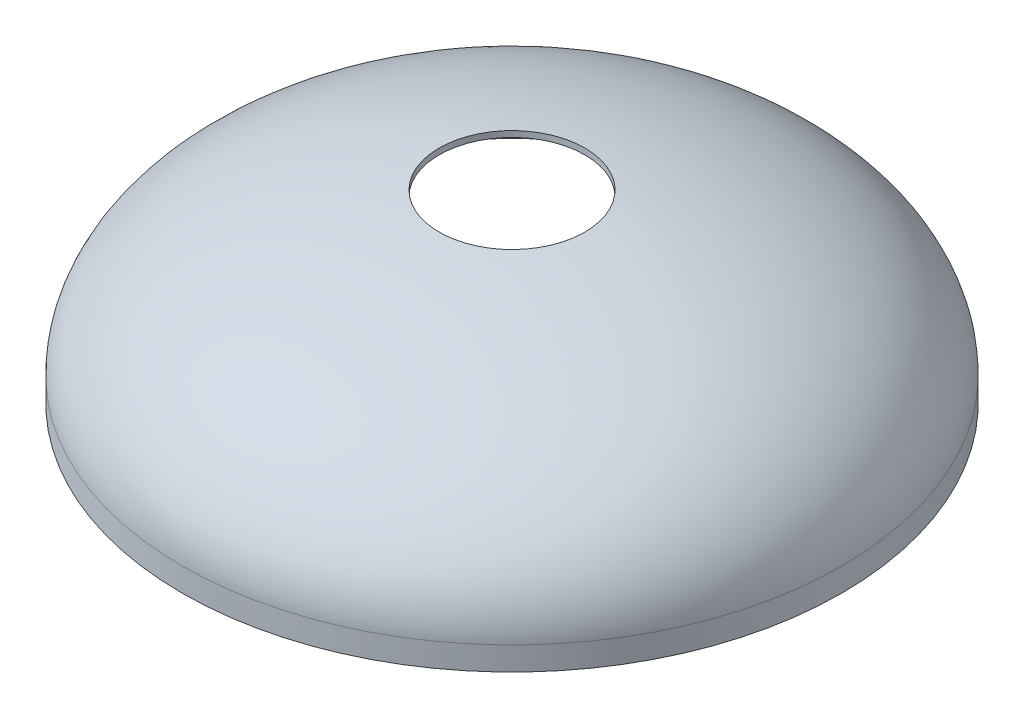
from build123d import *

# Parameters (mm, degrees)
SHELL1_T       = -12.7
SKETCH4_R      = 157.1625
NOZZLE_1_DEPTH = 456.946


with BuildPart() as part:
    # Sketch1 → Revolve1 (revolve)
    with BuildSketch(Plane.XY, mode=Mode.PRIVATE) as revolve1_sk:
        with BuildLine():
            Line((711.2, 0), (711.2, -50.8))
            Line((711.2, -50.8), (0, -50.8))
            Line((0, -50.8), (0, 355.6))
            add(Edge.make_bspline(
                [(711.2, 0), (711.2, 355.6), (0, 355.6)],
                knots=[3.141592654, 3.141592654, 3.141592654, 4.71238898, 4.71238898, 4.71238898], degree=2, weights=[1, 0.707106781, 1]))
        make_face()
    revolve(revolve1_sk.sketch.rotate(Axis((0, 441.323897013, 0), (0, -1, 0)), 180), axis=Axis((0, 441.323897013, 0), (0, -1, 0)))

    # Shell1
    shell1_openings = [part.faces().sort_by_distance(p)[0] for p in [
        (0, -50.8, 0),
    ]]
    offset(amount=SHELL1_T, openings=shell1_openings, kind=Kind.INTERSECTION)

    # Sketch4 → Nozzle 1 (cut)
    with BuildSketch(Plane(origin=(0, 0, 0), x_dir=(1, 0, 0), z_dir=(0, 1, 0))):
        with Locations(Location((0, 0, 0), (0, 0, 90))):
            Circle(SKETCH4_R)
    extrude(amount=NOZZLE_1_DEPTH, mode=Mode.SUBTRACT)


solid = part.part
